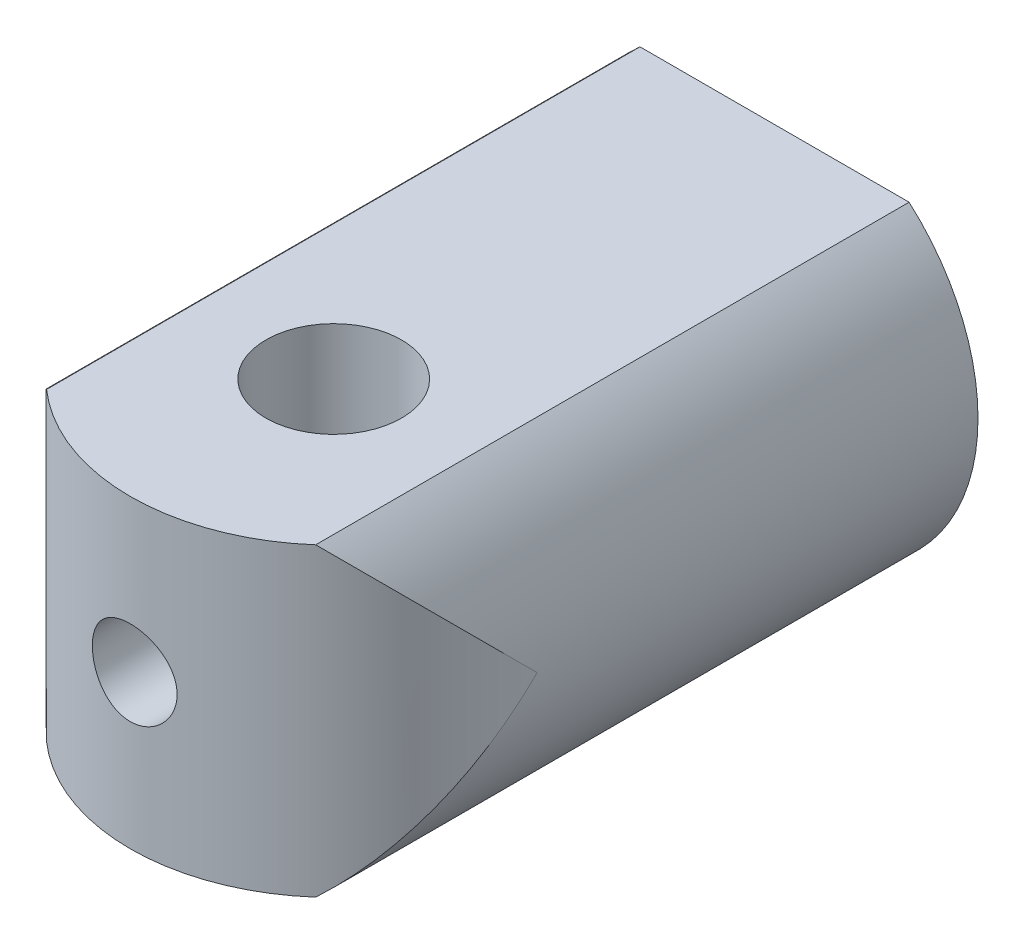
ISO-10303-21;
HEADER;
FILE_DESCRIPTION(('STEP AP214'),'2;1');
FILE_NAME('part.step','',(''),(''),'','','');
FILE_SCHEMA(('AUTOMOTIVE_DESIGN { 1 0 10303 214 1 1 1 1 }'));
ENDSEC;
DATA;
#1=APPLICATION_CONTEXT('core data for automotive mechanical design processes');
#2=APPLICATION_PROTOCOL_DEFINITION('international standard','automotive_design',2000,#1);
#3=PRODUCT_CONTEXT('',#1,'mechanical');
#4=PRODUCT('Part','Part','',(#3));
#5=PRODUCT_RELATED_PRODUCT_CATEGORY('part','',(#4));
#6=PRODUCT_DEFINITION_FORMATION('','',#4);
#7=PRODUCT_DEFINITION_CONTEXT('part definition',#1,'design');
#8=PRODUCT_DEFINITION('design','',#6,#7);
#9=PRODUCT_DEFINITION_SHAPE('','',#8);
#10=(LENGTH_UNIT() NAMED_UNIT(*) SI_UNIT(.MILLI.,.METRE.));
#11=(NAMED_UNIT(*) PLANE_ANGLE_UNIT() SI_UNIT($,.RADIAN.));
#12=(NAMED_UNIT(*) SI_UNIT($,.STERADIAN.) SOLID_ANGLE_UNIT());
#13=UNCERTAINTY_MEASURE_WITH_UNIT(LENGTH_MEASURE(1.E-05),#10,'distance_accuracy_value','');
#14=(GEOMETRIC_REPRESENTATION_CONTEXT(3) GLOBAL_UNCERTAINTY_ASSIGNED_CONTEXT((#13)) GLOBAL_UNIT_ASSIGNED_CONTEXT((#10,
#11,#12)) REPRESENTATION_CONTEXT('',''));
#15=CARTESIAN_POINT('',(0.,0.,0.));
#16=DIRECTION('',(0.,0.,1.));
#17=DIRECTION('',(1.,0.,0.));
#18=AXIS2_PLACEMENT_3D('',#15,#16,#17);
#19=CARTESIAN_POINT('',(0.,0.,38.));
#20=DIRECTION('',(0.,0.,-1.));
#21=DIRECTION('',(-1.,0.,0.));
#22=AXIS2_PLACEMENT_3D('',#19,#20,#21);
#23=CYLINDRICAL_SURFACE('',#22,12.);
#24=DIRECTION('',(0.,0.,-1.));
#25=VECTOR('',#24,1.);
#26=CARTESIAN_POINT('',(7.93725393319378,9.,38.));
#27=LINE('',#26,#25);
#28=CARTESIAN_POINT('',(7.93725393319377,9.,35.));
#29=VERTEX_POINT('',#28);
#30=CARTESIAN_POINT('',(7.93725393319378,9.,0.));
#31=VERTEX_POINT('',#30);
#32=EDGE_CURVE('E80',#29,#31,#27,.T.);
#33=ORIENTED_EDGE('',*,*,#32,.F.);
#34=CARTESIAN_POINT('',(0.,0.,26.));
#35=DIRECTION('',(0.,0.707106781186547,-0.707106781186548));
#36=DIRECTION('',(0.,-0.707106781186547,-0.707106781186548));
#37=AXIS2_PLACEMENT_3D('',#34,#35,#36);
#38=ELLIPSE('',#37,16.9705627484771,12.);
#39=CARTESIAN_POINT('',(12.,0.,26.));
#40=VERTEX_POINT('',#39);
#41=EDGE_CURVE('E89',#29,#40,#38,.T.);
#42=ORIENTED_EDGE('',*,*,#41,.T.);
#43=CARTESIAN_POINT('',(0.,0.,26.));
#44=DIRECTION('',(0.,-0.707106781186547,-0.707106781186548));
#45=DIRECTION('',(0.,0.707106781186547,-0.707106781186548));
#46=AXIS2_PLACEMENT_3D('',#43,#44,#45);
#47=ELLIPSE('',#46,16.9705627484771,12.);
#48=CARTESIAN_POINT('',(7.93725393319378,-9.,35.));
#49=VERTEX_POINT('',#48);
#50=EDGE_CURVE('E96',#40,#49,#47,.T.);
#51=ORIENTED_EDGE('',*,*,#50,.T.);
#52=DIRECTION('',(0.,0.,-1.));
#53=VECTOR('',#52,1.);
#54=CARTESIAN_POINT('',(7.93725393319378,-9.,38.));
#55=LINE('',#54,#53);
#56=CARTESIAN_POINT('',(7.93725393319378,-9.,0.));
#57=VERTEX_POINT('',#56);
#58=EDGE_CURVE('E54',#57,#49,#55,.F.);
#59=ORIENTED_EDGE('',*,*,#58,.F.);
#60=CARTESIAN_POINT('',(0.,0.,0.));
#61=DIRECTION('',(0.,0.,1.));
#62=DIRECTION('',(1.,0.,0.));
#63=AXIS2_PLACEMENT_3D('',#60,#61,#62);
#64=CIRCLE('',#63,12.);
#65=EDGE_CURVE('E92',#57,#31,#64,.T.);
#66=ORIENTED_EDGE('',*,*,#65,.T.);
#67=EDGE_LOOP('',(#33,#42,#51,#59,#66));
#68=FACE_BOUND('',#67,.T.);
#69=ADVANCED_FACE('F33',(#68),#23,.T.);
#70=DIRECTION('',(0.,0.,-1.));
#71=VECTOR('',#70,1.);
#72=CARTESIAN_POINT('',(-7.93725393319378,9.,38.));
#73=LINE('',#72,#71);
#74=CARTESIAN_POINT('',(-7.93725393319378,9.,0.));
#75=VERTEX_POINT('',#74);
#76=CARTESIAN_POINT('',(-7.93725393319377,9.,35.));
#77=VERTEX_POINT('',#76);
#78=EDGE_CURVE('E46',#75,#77,#73,.F.);
#79=ORIENTED_EDGE('',*,*,#78,.F.);
#80=CARTESIAN_POINT('',(-7.93725393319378,-9.,0.));
#81=VERTEX_POINT('',#80);
#82=EDGE_CURVE('E106',#75,#81,#64,.T.);
#83=ORIENTED_EDGE('',*,*,#82,.T.);
#84=DIRECTION('',(0.,0.,-1.));
#85=VECTOR('',#84,1.);
#86=CARTESIAN_POINT('',(-7.93725393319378,-9.,38.));
#87=LINE('',#86,#85);
#88=CARTESIAN_POINT('',(-7.93725393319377,-9.,35.));
#89=VERTEX_POINT('',#88);
#90=EDGE_CURVE('E101',#89,#81,#87,.T.);
#91=ORIENTED_EDGE('',*,*,#90,.F.);
#92=CARTESIAN_POINT('',(-12.,0.,26.));
#93=VERTEX_POINT('',#92);
#94=EDGE_CURVE('E100',#89,#93,#47,.T.);
#95=ORIENTED_EDGE('',*,*,#94,.T.);
#96=EDGE_CURVE('E97',#93,#77,#38,.T.);
#97=ORIENTED_EDGE('',*,*,#96,.T.);
#98=EDGE_LOOP('',(#79,#83,#91,#95,#97));
#99=FACE_BOUND('',#98,.T.);
#100=ADVANCED_FACE('F147',(#99),#23,.T.);
#101=CARTESIAN_POINT('',(0.,0.,0.));
#102=DIRECTION('',(0.,0.,1.));
#103=DIRECTION('',(1.,0.,0.));
#104=AXIS2_PLACEMENT_3D('',#101,#102,#103);
#105=PLANE('',#104);
#106=CARTESIAN_POINT('',(0.,0.,0.));
#107=DIRECTION('',(0.,0.,-1.));
#108=DIRECTION('',(-1.,0.,0.));
#109=AXIS2_PLACEMENT_3D('',#106,#107,#108);
#110=CIRCLE('',#109,3.4);
#111=CARTESIAN_POINT('',(-3.4,0.,0.));
#112=VERTEX_POINT('',#111);
#113=EDGE_CURVE('E165',#112,#112,#110,.T.);
#114=ORIENTED_EDGE('',*,*,#113,.F.);
#115=EDGE_LOOP('',(#114));
#116=FACE_BOUND('',#115,.T.);
#117=DIRECTION('',(-1.,0.,0.));
#118=VECTOR('',#117,1.);
#119=CARTESIAN_POINT('',(0.,9.,0.));
#120=LINE('',#119,#118);
#121=EDGE_CURVE('E93',#31,#75,#120,.T.);
#122=ORIENTED_EDGE('',*,*,#121,.F.);
#123=ORIENTED_EDGE('',*,*,#65,.F.);
#124=DIRECTION('',(1.,0.,0.));
#125=VECTOR('',#124,1.);
#126=CARTESIAN_POINT('',(0.,-9.,0.));
#127=LINE('',#126,#125);
#128=EDGE_CURVE('E98',#81,#57,#127,.T.);
#129=ORIENTED_EDGE('',*,*,#128,.F.);
#130=ORIENTED_EDGE('',*,*,#82,.F.);
#131=EDGE_LOOP('',(#122,#123,#129,#130));
#132=FACE_BOUND('',#131,.T.);
#133=ADVANCED_FACE('F151',(#116,#132),#105,.F.);
#134=CARTESIAN_POINT('',(0.,-12.,26.));
#135=DIRECTION('',(0.,1.,0.));
#136=DIRECTION('',(0.,0.,1.));
#137=AXIS2_PLACEMENT_3D('',#134,#135,#136);
#138=CYLINDRICAL_SURFACE('',#137,12.);
#139=CARTESIAN_POINT('',(2.49999999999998,0.,37.7366945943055));
#140=CARTESIAN_POINT('',(2.49999501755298,-0.138781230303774,37.7366973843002));
#141=CARTESIAN_POINT('',(2.48840458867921,-0.277623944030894,37.7391829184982));
#142=CARTESIAN_POINT('',(2.44239298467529,-0.551372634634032,37.7488403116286));
#143=CARTESIAN_POINT('',(2.40795430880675,-0.686275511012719,37.7560157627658));
#144=CARTESIAN_POINT('',(2.31736795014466,-0.948144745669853,37.7742058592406));
#145=CARTESIAN_POINT('',(2.26124282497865,-1.07511919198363,37.7852165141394));
#146=CARTESIAN_POINT('',(2.12893977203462,-1.31784899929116,37.8098316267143));
#147=CARTESIAN_POINT('',(2.05276265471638,-1.43360481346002,37.8234359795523));
#148=CARTESIAN_POINT('',(1.88127279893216,-1.65239075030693,37.8519386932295));
#149=CARTESIAN_POINT('',(1.78571110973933,-1.75522378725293,37.8668522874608));
#150=CARTESIAN_POINT('',(1.57870244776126,-1.94352213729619,37.8961593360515));
#151=CARTESIAN_POINT('',(1.467254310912,-2.02898617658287,37.9105527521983));
#152=CARTESIAN_POINT('',(1.23032410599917,-2.18089177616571,37.937362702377));
#153=CARTESIAN_POINT('',(1.10471885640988,-2.24714505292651,37.9497591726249));
#154=CARTESIAN_POINT('',(0.843857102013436,-2.35753210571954,37.971006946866));
#155=CARTESIAN_POINT('',(0.708601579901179,-2.40166813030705,37.9798586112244));
#156=CARTESIAN_POINT('',(0.434325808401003,-2.46595152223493,37.9929117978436));
#157=CARTESIAN_POINT('',(0.295386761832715,-2.48643203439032,37.9971778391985));
#158=CARTESIAN_POINT('',(0.0159836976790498,-2.50386339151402,38.0008022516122));
#159=CARTESIAN_POINT('',(-0.124480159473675,-2.50081668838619,38.0001611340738));
#160=CARTESIAN_POINT('',(-0.40065317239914,-2.4715307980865,37.9940931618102));
#161=CARTESIAN_POINT('',(-0.536402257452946,-2.44565056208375,37.9887403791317));
#162=CARTESIAN_POINT('',(-0.801587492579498,-2.37200274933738,37.9739344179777));
#163=CARTESIAN_POINT('',(-0.931023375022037,-2.32423424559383,37.9644810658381));
#164=CARTESIAN_POINT('',(-1.18092001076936,-2.20783989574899,37.9424153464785));
#165=CARTESIAN_POINT('',(-1.30131426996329,-2.13907541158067,37.9297820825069));
#166=CARTESIAN_POINT('',(-1.52898691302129,-1.98274399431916,37.9027460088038));
#167=CARTESIAN_POINT('',(-1.63626366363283,-1.89517472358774,37.8883429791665));
#168=CARTESIAN_POINT('',(-1.83678840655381,-1.70175675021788,37.8590340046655));
#169=CARTESIAN_POINT('',(-1.92973297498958,-1.5955938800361,37.8441236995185));
#170=CARTESIAN_POINT('',(-2.09655194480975,-1.36903590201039,37.8157374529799));
#171=CARTESIAN_POINT('',(-2.17042592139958,-1.24864047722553,37.8022615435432));
#172=CARTESIAN_POINT('',(-2.29712434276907,-0.9965754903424,37.7782599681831));
#173=CARTESIAN_POINT('',(-2.34989610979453,-0.86487869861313,37.7677417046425));
#174=CARTESIAN_POINT('',(-2.43247155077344,-0.594216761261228,37.7509521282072));
#175=CARTESIAN_POINT('',(-2.46227849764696,-0.455252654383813,37.7446802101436));
#176=CARTESIAN_POINT('',(-2.49761727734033,-0.176760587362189,37.7372156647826));
#177=CARTESIAN_POINT('',(-2.50358885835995,-0.0372908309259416,37.7359310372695));
#178=CARTESIAN_POINT('',(-2.49227386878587,0.240651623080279,37.7383390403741));
#179=CARTESIAN_POINT('',(-2.47498873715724,0.379124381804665,37.7420313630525));
#180=CARTESIAN_POINT('',(-2.41803116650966,0.649641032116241,37.7538907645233));
#181=CARTESIAN_POINT('',(-2.37859682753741,0.78173733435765,37.7620102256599));
#182=CARTESIAN_POINT('',(-2.27871621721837,1.0374479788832,37.7817667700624));
#183=CARTESIAN_POINT('',(-2.21826809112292,1.16106157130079,37.7934041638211));
#184=CARTESIAN_POINT('',(-2.07709196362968,1.39821288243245,37.8190900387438));
#185=CARTESIAN_POINT('',(-1.99609065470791,1.51158440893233,37.8331701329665));
#186=CARTESIAN_POINT('',(-1.81646888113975,1.72328649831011,37.8620696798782));
#187=CARTESIAN_POINT('',(-1.71784644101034,1.82161537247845,37.8768892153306));
#188=CARTESIAN_POINT('',(-1.50380090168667,2.00212542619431,37.9058984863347));
#189=CARTESIAN_POINT('',(-1.3881238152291,2.08400819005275,37.9200734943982));
#190=CARTESIAN_POINT('',(-1.14440020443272,2.22717750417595,37.9459341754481));
#191=CARTESIAN_POINT('',(-1.01635422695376,2.28846496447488,37.9576199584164));
#192=CARTESIAN_POINT('',(-0.752284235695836,2.38827735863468,37.9771229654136));
#193=CARTESIAN_POINT('',(-0.616313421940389,2.42693833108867,37.9849632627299));
#194=CARTESIAN_POINT('',(-0.339626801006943,2.48082880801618,37.9959912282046));
#195=CARTESIAN_POINT('',(-0.198911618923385,2.49606138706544,37.9991795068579));
#196=CARTESIAN_POINT('',(0.0804266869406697,2.50253524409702,38.0005281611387));
#197=CARTESIAN_POINT('',(0.219039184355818,2.49422379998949,37.9987822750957));
#198=CARTESIAN_POINT('',(0.492845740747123,2.45483872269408,37.99065748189));
#199=CARTESIAN_POINT('',(0.628039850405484,2.4237654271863,37.9842786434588));
#200=CARTESIAN_POINT('',(0.890863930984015,2.33994441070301,37.9676092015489));
#201=CARTESIAN_POINT('',(1.01851310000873,2.28725467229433,37.9573290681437));
#202=CARTESIAN_POINT('',(1.26322113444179,2.16175520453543,37.9339599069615));
#203=CARTESIAN_POINT('',(1.38027907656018,2.08894372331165,37.9208706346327));
#204=CARTESIAN_POINT('',(1.60268064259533,1.92378066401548,37.8930319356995));
#205=CARTESIAN_POINT('',(1.70778526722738,1.83111142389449,37.8782576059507));
#206=CARTESIAN_POINT('',(1.90110548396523,1.62951099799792,37.8488557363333));
#207=CARTESIAN_POINT('',(1.98931704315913,1.5205759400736,37.8342282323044));
#208=CARTESIAN_POINT('',(2.1473490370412,1.28798179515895,37.8065838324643));
#209=CARTESIAN_POINT('',(2.21693856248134,1.16416317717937,37.7935881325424));
#210=CARTESIAN_POINT('',(2.33421255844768,0.90634968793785,37.7709407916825));
#211=CARTESIAN_POINT('',(2.38191632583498,0.7723639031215,37.7612862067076));
#212=CARTESIAN_POINT('',(2.44513108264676,0.531787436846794,37.7482800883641));
#213=CARTESIAN_POINT('',(2.46566898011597,0.426540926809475,37.7439632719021));
#214=CARTESIAN_POINT('',(2.49310508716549,0.214208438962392,37.7381695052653));
#215=CARTESIAN_POINT('',(2.50000384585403,0.107122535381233,37.7366924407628));
#216=CARTESIAN_POINT('',(2.49999999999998,0.,37.7366945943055));
#217=B_SPLINE_CURVE_WITH_KNOTS('',3,(#139,#140,#141,#142,#143,#144,#145,#146,#147,#148,#149,
#150,#151,#152,#153,#154,#155,#156,#157,#158,#159,#160,#161,#162,#163,#164,#165,#166,#167,#168,
#169,#170,#171,#172,#173,#174,#175,#176,#177,#178,#179,#180,#181,#182,#183,#184,#185,#186,#187,
#188,#189,#190,#191,#192,#193,#194,#195,#196,#197,#198,#199,#200,#201,#202,#203,#204,#205,#206,
#207,#208,#209,#210,#211,#212,#213,#214,#215,#216),.UNSPECIFIED.,.T.,.F.,(4,2,2,2,2,2,2,2,2,2,2,
2,2,2,2,2,2,2,2,2,2,2,2,2,2,2,2,2,2,2,2,2,2,2,2,2,2,2,4),(0.,0.415951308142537,
0.832221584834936,1.24806002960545,1.66388166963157,2.08542666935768,2.50700257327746,
2.93258052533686,3.35811520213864,3.77758097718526,4.19700303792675,4.60994682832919,
5.02290810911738,5.43865743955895,5.85445848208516,6.27811724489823,6.70178544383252,
7.12650474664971,7.55116350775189,7.96795032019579,8.38471134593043,8.7970757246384,
9.20947650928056,9.62767835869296,10.0459271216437,10.4711891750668,10.8964324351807,
11.3190919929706,11.7416960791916,12.1563258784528,12.5709495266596,12.9844682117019,
13.3980229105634,13.8187663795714,14.2396101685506,14.6654530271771,15.0909196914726,
15.4119973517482,15.7330620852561),.UNSPECIFIED.);
#218=CARTESIAN_POINT('',(2.49999999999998,0.,37.7366945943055));
#219=VERTEX_POINT('',#218);
#220=EDGE_CURVE('E107',#219,#219,#217,.T.);
#221=ORIENTED_EDGE('',*,*,#220,.T.);
#222=EDGE_LOOP('',(#221));
#223=FACE_BOUND('',#222,.T.);
#224=CARTESIAN_POINT('',(0.,9.,26.));
#225=DIRECTION('',(0.,1.,0.));
#226=DIRECTION('',(0.,0.,1.));
#227=AXIS2_PLACEMENT_3D('',#224,#225,#226);
#228=CIRCLE('',#227,12.);
#229=EDGE_CURVE('E11',#77,#29,#228,.T.);
#230=ORIENTED_EDGE('',*,*,#229,.F.);
#231=ORIENTED_EDGE('',*,*,#96,.F.);
#232=ORIENTED_EDGE('',*,*,#94,.F.);
#233=CARTESIAN_POINT('',(0.,-9.,26.));
#234=DIRECTION('',(0.,-1.,0.));
#235=DIRECTION('',(0.,0.,-1.));
#236=AXIS2_PLACEMENT_3D('',#233,#234,#235);
#237=CIRCLE('',#236,12.);
#238=EDGE_CURVE('E40',#49,#89,#237,.T.);
#239=ORIENTED_EDGE('',*,*,#238,.F.);
#240=ORIENTED_EDGE('',*,*,#50,.F.);
#241=ORIENTED_EDGE('',*,*,#41,.F.);
#242=EDGE_LOOP('',(#230,#231,#232,#239,#240,#241));
#243=FACE_BOUND('',#242,.T.);
#244=ADVANCED_FACE('F95',(#223,#243),#138,.T.);
#245=CARTESIAN_POINT('',(-52.2218339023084,-9.,-3.67264960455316));
#246=DIRECTION('',(0.,-1.,0.));
#247=DIRECTION('',(0.,0.,-1.));
#248=AXIS2_PLACEMENT_3D('',#245,#246,#247);
#249=PLANE('',#248);
#250=CARTESIAN_POINT('',(0.,-9.,26.));
#251=DIRECTION('',(0.,1.,0.));
#252=DIRECTION('',(0.,0.,1.));
#253=AXIS2_PLACEMENT_3D('',#250,#251,#252);
#254=CIRCLE('',#253,4.);
#255=CARTESIAN_POINT('',(0.,-9.,30.));
#256=VERTEX_POINT('',#255);
#257=EDGE_CURVE('E133',#256,#256,#254,.T.);
#258=ORIENTED_EDGE('',*,*,#257,.T.);
#259=EDGE_LOOP('',(#258));
#260=FACE_BOUND('',#259,.T.);
#261=ORIENTED_EDGE('',*,*,#128,.T.);
#262=ORIENTED_EDGE('',*,*,#58,.T.);
#263=ORIENTED_EDGE('',*,*,#238,.T.);
#264=ORIENTED_EDGE('',*,*,#90,.T.);
#265=EDGE_LOOP('',(#261,#262,#263,#264));
#266=FACE_BOUND('',#265,.T.);
#267=ADVANCED_FACE('F163',(#260,#266),#249,.T.);
#268=CARTESIAN_POINT('',(0.,0.,0.));
#269=DIRECTION('',(0.,0.,-1.));
#270=DIRECTION('',(-1.,0.,0.));
#271=AXIS2_PLACEMENT_3D('',#268,#269,#270);
#272=CYLINDRICAL_SURFACE('',#271,3.4);
#273=CARTESIAN_POINT('',(0.,0.,16.));
#274=DIRECTION('',(0.,0.,-1.));
#275=DIRECTION('',(-1.,0.,0.));
#276=AXIS2_PLACEMENT_3D('',#273,#274,#275);
#277=CIRCLE('',#276,3.4);
#278=CARTESIAN_POINT('',(-3.4,0.,16.));
#279=VERTEX_POINT('',#278);
#280=EDGE_CURVE('E113',#279,#279,#277,.T.);
#281=ORIENTED_EDGE('',*,*,#280,.F.);
#282=EDGE_LOOP('',(#281));
#283=FACE_BOUND('',#282,.T.);
#284=ORIENTED_EDGE('',*,*,#113,.T.);
#285=EDGE_LOOP('',(#284));
#286=FACE_BOUND('',#285,.T.);
#287=ADVANCED_FACE('F175',(#283,#286),#272,.F.);
#288=CARTESIAN_POINT('',(0.,0.,16.));
#289=DIRECTION('',(0.,0.,-1.));
#290=DIRECTION('',(-1.,0.,0.));
#291=AXIS2_PLACEMENT_3D('',#288,#289,#290);
#292=CONICAL_SURFACE('',#291,3.4,1.02974425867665);
#293=CARTESIAN_POINT('',(0.,0.,18.0429261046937));
#294=VERTEX_POINT('',#293);
#295=VERTEX_LOOP('',#294);
#296=FACE_BOUND('',#295,.T.);
#297=ORIENTED_EDGE('',*,*,#280,.T.);
#298=EDGE_LOOP('',(#297));
#299=FACE_BOUND('',#298,.T.);
#300=ADVANCED_FACE('F121',(#296,#299),#292,.F.);
#301=CARTESIAN_POINT('',(0.,0.,114.));
#302=DIRECTION('',(0.,0.,1.));
#303=DIRECTION('',(1.,0.,0.));
#304=AXIS2_PLACEMENT_3D('',#301,#302,#303);
#305=CYLINDRICAL_SURFACE('',#304,2.49999999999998);
#306=CARTESIAN_POINT('',(2.49999999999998,0.,29.1224989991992));
#307=CARTESIAN_POINT('',(2.49999941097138,-0.0621567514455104,29.1224999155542));
#308=CARTESIAN_POINT('',(2.49767581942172,-0.124325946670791,29.1243649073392));
#309=CARTESIAN_POINT('',(2.48843349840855,-0.248117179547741,29.1317292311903));
#310=CARTESIAN_POINT('',(2.48151206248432,-0.3097388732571,29.1372307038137));
#311=CARTESIAN_POINT('',(2.45397595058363,-0.493226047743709,29.1588895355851));
#312=CARTESIAN_POINT('',(2.42658990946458,-0.613548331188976,29.1802003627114));
#313=CARTESIAN_POINT('',(2.35576217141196,-0.845598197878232,29.2329977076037));
#314=CARTESIAN_POINT('',(2.312459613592,-0.957390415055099,29.2643957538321));
#315=CARTESIAN_POINT('',(2.21143916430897,-1.17200852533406,29.3336600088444));
#316=CARTESIAN_POINT('',(2.15372087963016,-1.27483417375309,29.3715263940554));
#317=CARTESIAN_POINT('',(2.01647682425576,-1.48373398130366,29.4555922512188));
#318=CARTESIAN_POINT('',(1.93506425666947,-1.58839332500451,29.5022281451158));
#319=CARTESIAN_POINT('',(1.7566252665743,-1.78376155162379,29.5950550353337));
#320=CARTESIAN_POINT('',(1.6595853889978,-1.87445827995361,29.6412456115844));
#321=CARTESIAN_POINT('',(1.43833990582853,-2.05022029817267,29.7345952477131));
#322=CARTESIAN_POINT('',(1.3122693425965,-2.13328618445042,29.7811988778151));
#323=CARTESIAN_POINT('',(1.11163395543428,-2.24054515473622,29.8430725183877));
#324=CARTESIAN_POINT('',(1.04281240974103,-2.2734151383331,29.8623628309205));
#325=CARTESIAN_POINT('',(0.90175876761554,-2.33295468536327,29.8977043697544));
#326=CARTESIAN_POINT('',(0.829529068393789,-2.35962853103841,29.9137578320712));
#327=CARTESIAN_POINT('',(0.689700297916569,-2.40398381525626,29.9406675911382));
#328=CARTESIAN_POINT('',(0.622371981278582,-2.42230197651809,29.9518853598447));
#329=CARTESIAN_POINT('',(0.485997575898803,-2.45330228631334,29.9709624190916));
#330=CARTESIAN_POINT('',(0.416952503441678,-2.4659876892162,29.9788236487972));
#331=CARTESIAN_POINT('',(0.27776544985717,-2.48551379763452,29.9909547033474));
#332=CARTESIAN_POINT('',(0.207624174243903,-2.4923581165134,29.9952267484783));
#333=CARTESIAN_POINT('',(0.0669114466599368,-2.50009921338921,30.0000612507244));
#334=CARTESIAN_POINT('',(-0.0036599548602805,-2.50099667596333,30.0006241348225));
#335=CARTESIAN_POINT('',(-0.196045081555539,-2.49527462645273,29.997044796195));
#336=CARTESIAN_POINT('',(-0.317681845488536,-2.4826934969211,29.9891704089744));
#337=CARTESIAN_POINT('',(-0.556636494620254,-2.44026978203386,29.9629090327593));
#338=CARTESIAN_POINT('',(-0.673954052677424,-2.41042589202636,29.9445212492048));
#339=CARTESIAN_POINT('',(-0.901771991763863,-2.33479144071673,29.8987617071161));
#340=CARTESIAN_POINT('',(-1.01225407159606,-2.28896008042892,29.8713669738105));
#341=CARTESIAN_POINT('',(-1.22404012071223,-2.18306276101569,29.8097129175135));
#342=CARTESIAN_POINT('',(-1.32534199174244,-2.12299355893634,29.7754520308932));
#343=CARTESIAN_POINT('',(-1.52942649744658,-1.98194358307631,29.6978644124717));
#344=CARTESIAN_POINT('',(-1.63082454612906,-1.89929072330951,29.6539400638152));
#345=CARTESIAN_POINT('',(-1.81919733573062,-1.71973526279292,29.5639092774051));
#346=CARTESIAN_POINT('',(-1.90615071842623,-1.62281195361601,29.5177997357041));
#347=CARTESIAN_POINT('',(-2.07470887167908,-1.4025887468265,29.4214288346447));
#348=CARTESIAN_POINT('',(-2.15413229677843,-1.27749723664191,29.371411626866));
#349=CARTESIAN_POINT('',(-2.29052307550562,-1.01270776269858,29.2802827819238));
#350=CARTESIAN_POINT('',(-2.34753179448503,-0.873037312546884,29.2391548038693));
#351=CARTESIAN_POINT('',(-2.4243713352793,-0.620461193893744,29.1818375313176));
#352=CARTESIAN_POINT('',(-2.45003683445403,-0.510178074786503,29.1619340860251));
#353=CARTESIAN_POINT('',(-2.4862033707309,-0.285769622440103,29.1335827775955));
#354=CARTESIAN_POINT('',(-2.4967251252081,-0.171649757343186,29.1251192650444));
#355=CARTESIAN_POINT('',(-2.50197072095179,0.0574573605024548,29.1209226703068));
#356=CARTESIAN_POINT('',(-2.49665835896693,0.17244600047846,29.1252187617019));
#357=CARTESIAN_POINT('',(-2.47051466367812,0.399561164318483,29.1459208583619));
#358=CARTESIAN_POINT('',(-2.44967047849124,0.511685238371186,29.1623368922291));
#359=CARTESIAN_POINT('',(-2.39409874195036,0.728436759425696,29.2046012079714));
#360=CARTESIAN_POINT('',(-2.35960571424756,0.83315731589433,29.2302895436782));
#361=CARTESIAN_POINT('',(-2.27804893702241,1.03557469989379,29.2883114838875));
#362=CARTESIAN_POINT('',(-2.23098072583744,1.13326901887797,29.3206474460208));
#363=CARTESIAN_POINT('',(-2.11530798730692,1.3386119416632,29.395744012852));
#364=CARTESIAN_POINT('',(-2.04430931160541,1.44461452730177,29.4393172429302));
#365=CARTESIAN_POINT('',(-1.88737868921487,1.64437066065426,29.5278794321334));
#366=CARTESIAN_POINT('',(-1.80143124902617,1.73811132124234,29.5728698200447));
#367=CARTESIAN_POINT('',(-1.60076932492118,1.92596407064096,29.6676620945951));
#368=CARTESIAN_POINT('',(-1.48365201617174,2.0177273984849,29.717079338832));
#369=CARTESIAN_POINT('',(-1.23256787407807,2.18014701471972,29.8076897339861));
#370=CARTESIAN_POINT('',(-1.09860897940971,2.25081319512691,29.8488867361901));
#371=CARTESIAN_POINT('',(-0.891930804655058,2.33658106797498,29.8998896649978));
#372=CARTESIAN_POINT('',(-0.824318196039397,2.36129744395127,29.9147705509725));
#373=CARTESIAN_POINT('',(-0.686640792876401,2.40493827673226,29.9412464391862));
#374=CARTESIAN_POINT('',(-0.616577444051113,2.42386608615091,29.9528433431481));
#375=CARTESIAN_POINT('',(-0.474639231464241,2.45560583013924,29.9723851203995));
#376=CARTESIAN_POINT('',(-0.402766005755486,2.46842309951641,29.9803331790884));
#377=CARTESIAN_POINT('',(-0.257881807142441,2.48773917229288,29.9923416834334));
#378=CARTESIAN_POINT('',(-0.184871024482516,2.49423902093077,29.9964027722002));
#379=CARTESIAN_POINT('',(0.0131102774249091,2.50307151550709,30.0019152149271));
#380=CARTESIAN_POINT('',(0.138539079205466,2.49926579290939,29.9995270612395));
#381=CARTESIAN_POINT('',(0.386583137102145,2.47308241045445,29.9832197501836));
#382=CARTESIAN_POINT('',(0.509198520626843,2.45070559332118,29.9693011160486));
#383=CARTESIAN_POINT('',(0.74408060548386,2.38967758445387,29.9319208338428));
#384=CARTESIAN_POINT('',(0.856558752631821,2.35161792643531,29.908807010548));
#385=CARTESIAN_POINT('',(1.07343034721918,2.2608805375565,29.8548997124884));
#386=CARTESIAN_POINT('',(1.17782242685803,2.20820034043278,29.8241049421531));
#387=CARTESIAN_POINT('',(1.38731297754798,2.08367872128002,29.7535067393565));
#388=CARTESIAN_POINT('',(1.4913601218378,2.01041600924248,29.7131000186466));
#389=CARTESIAN_POINT('',(1.68643334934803,1.84984676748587,29.6286728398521));
#390=CARTESIAN_POINT('',(1.77744451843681,1.76252439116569,29.584648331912));
#391=CARTESIAN_POINT('',(1.95744716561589,1.56176748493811,29.4900082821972));
#392=CARTESIAN_POINT('',(2.04425661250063,1.44638338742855,29.439357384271));
#393=CARTESIAN_POINT('',(2.19754648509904,1.20071059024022,29.3434964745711));
#394=CARTESIAN_POINT('',(2.26403815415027,1.07043018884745,29.2982834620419));
#395=CARTESIAN_POINT('',(2.3619822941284,0.827194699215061,29.2285953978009));
#396=CARTESIAN_POINT('',(2.39792458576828,0.71672942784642,29.2017463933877));
#397=CARTESIAN_POINT('',(2.45425618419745,0.490060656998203,29.1587835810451));
#398=CARTESIAN_POINT('',(2.47469472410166,0.373876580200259,29.1426358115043));
#399=CARTESIAN_POINT('',(2.4911984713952,0.21394000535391,29.1295285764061));
#400=CARTESIAN_POINT('',(2.49449433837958,0.171274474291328,29.1268999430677));
#401=CARTESIAN_POINT('',(2.49889558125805,0.0857413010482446,29.1233846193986));
#402=CARTESIAN_POINT('',(2.50000040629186,0.0428736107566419,29.1224983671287));
#403=CARTESIAN_POINT('',(2.49999999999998,0.,29.1224989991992));
#404=B_SPLINE_CURVE_WITH_KNOTS('',3,(#306,#307,#308,#309,#310,#311,#312,#313,#314,#315,#316,
#317,#318,#319,#320,#321,#322,#323,#324,#325,#326,#327,#328,#329,#330,#331,#332,#333,#334,#335,
#336,#337,#338,#339,#340,#341,#342,#343,#344,#345,#346,#347,#348,#349,#350,#351,#352,#353,#354,
#355,#356,#357,#358,#359,#360,#361,#362,#363,#364,#365,#366,#367,#368,#369,#370,#371,#372,#373,
#374,#375,#376,#377,#378,#379,#380,#381,#382,#383,#384,#385,#386,#387,#388,#389,#390,#391,#392,
#393,#394,#395,#396,#397,#398,#399,#400,#401,#402,#403),.UNSPECIFIED.,.T.,.F.,(4,2,2,2,2,2,2,2,
2,2,2,2,2,2,2,2,2,2,2,2,2,2,2,2,2,2,2,2,2,2,2,2,2,2,2,2,2,2,2,2,2,2,2,2,2,2,2,2,4),(0.,
0.186415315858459,0.372940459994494,0.746478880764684,1.11682668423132,1.48718459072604,
1.9072279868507,2.32763499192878,2.79876029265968,3.03445880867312,3.26999394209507,
3.48170145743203,3.69328649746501,3.90474055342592,4.11617026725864,4.48184709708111,
4.84755156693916,5.21419620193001,5.58092442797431,5.99329080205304,6.40626158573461,
6.87316206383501,7.33919680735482,7.68265621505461,8.02564530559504,8.36941921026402,
8.71347788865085,9.05186495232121,9.39037223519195,9.79332737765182,10.1967026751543,
10.6647326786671,11.1325428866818,11.3527929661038,11.5729152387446,11.7928449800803,
12.0127383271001,12.3871595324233,12.7615637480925,13.1229788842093,13.4844550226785,
13.8834503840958,14.2828986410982,14.7399238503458,15.1966956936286,15.5530255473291,
15.9082190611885,16.0367696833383,16.1653526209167),.UNSPECIFIED.);
#405=CARTESIAN_POINT('',(2.49999999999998,0.,29.1224989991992));
#406=VERTEX_POINT('',#405);
#407=EDGE_CURVE('E127',#406,#406,#404,.T.);
#408=ORIENTED_EDGE('',*,*,#407,.T.);
#409=EDGE_LOOP('',(#408));
#410=FACE_BOUND('',#409,.T.);
#411=ORIENTED_EDGE('',*,*,#220,.F.);
#412=EDGE_LOOP('',(#411));
#413=FACE_BOUND('',#412,.T.);
#414=ADVANCED_FACE('F116',(#410,#413),#305,.F.);
#415=CARTESIAN_POINT('',(30.8853146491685,9.,-4.36896059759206));
#416=DIRECTION('',(0.,1.,0.));
#417=DIRECTION('',(0.,0.,1.));
#418=AXIS2_PLACEMENT_3D('',#415,#416,#417);
#419=PLANE('',#418);
#420=CARTESIAN_POINT('',(0.,9.,26.));
#421=DIRECTION('',(0.,1.,0.));
#422=DIRECTION('',(0.,0.,1.));
#423=AXIS2_PLACEMENT_3D('',#420,#421,#422);
#424=CIRCLE('',#423,4.);
#425=CARTESIAN_POINT('',(0.,9.,30.));
#426=VERTEX_POINT('',#425);
#427=EDGE_CURVE('E134',#426,#426,#424,.T.);
#428=ORIENTED_EDGE('',*,*,#427,.F.);
#429=EDGE_LOOP('',(#428));
#430=FACE_BOUND('',#429,.T.);
#431=ORIENTED_EDGE('',*,*,#121,.T.);
#432=ORIENTED_EDGE('',*,*,#78,.T.);
#433=ORIENTED_EDGE('',*,*,#229,.T.);
#434=ORIENTED_EDGE('',*,*,#32,.T.);
#435=EDGE_LOOP('',(#431,#432,#433,#434));
#436=FACE_BOUND('',#435,.T.);
#437=ADVANCED_FACE('F79',(#430,#436),#419,.T.);
#438=CARTESIAN_POINT('',(0.,-9.,26.));
#439=DIRECTION('',(0.,1.,0.));
#440=DIRECTION('',(0.,0.,1.));
#441=AXIS2_PLACEMENT_3D('',#438,#439,#440);
#442=CYLINDRICAL_SURFACE('',#441,4.);
#443=ORIENTED_EDGE('',*,*,#427,.T.);
#444=EDGE_LOOP('',(#443));
#445=FACE_BOUND('',#444,.T.);
#446=ORIENTED_EDGE('',*,*,#257,.F.);
#447=EDGE_LOOP('',(#446));
#448=FACE_BOUND('',#447,.T.);
#449=ORIENTED_EDGE('',*,*,#407,.F.);
#450=EDGE_LOOP('',(#449));
#451=FACE_BOUND('',#450,.T.);
#452=ADVANCED_FACE('F136',(#445,#448,#451),#442,.F.);
#453=CLOSED_SHELL('',(#69,#100,#133,#244,#267,#287,#300,#414,#437,#452));
#454=MANIFOLD_SOLID_BREP('B2',#453);
#455=ADVANCED_BREP_SHAPE_REPRESENTATION('',(#18,#454),#14);
#456=SHAPE_DEFINITION_REPRESENTATION(#9,#455);
ENDSEC;
END-ISO-10303-21;
